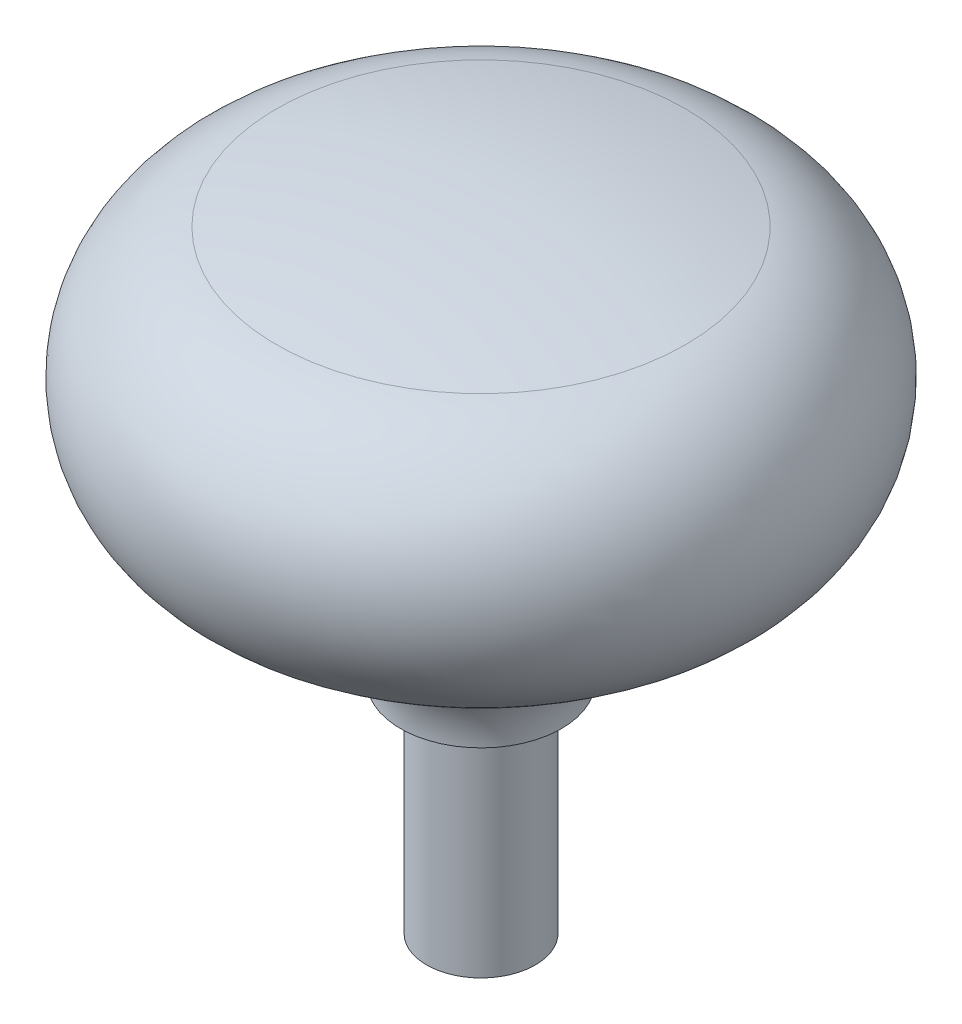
ISO-10303-21;
HEADER;
FILE_DESCRIPTION(('STEP AP214'),'2;1');
FILE_NAME('part.step','',(''),(''),'','','');
FILE_SCHEMA(('AUTOMOTIVE_DESIGN { 1 0 10303 214 1 1 1 1 }'));
ENDSEC;
DATA;
#1=APPLICATION_CONTEXT('core data for automotive mechanical design processes');
#2=APPLICATION_PROTOCOL_DEFINITION('international standard','automotive_design',2000,#1);
#3=PRODUCT_CONTEXT('',#1,'mechanical');
#4=PRODUCT('Part','Part','',(#3));
#5=PRODUCT_RELATED_PRODUCT_CATEGORY('part','',(#4));
#6=PRODUCT_DEFINITION_FORMATION('','',#4);
#7=PRODUCT_DEFINITION_CONTEXT('part definition',#1,'design');
#8=PRODUCT_DEFINITION('design','',#6,#7);
#9=PRODUCT_DEFINITION_SHAPE('','',#8);
#10=(LENGTH_UNIT() NAMED_UNIT(*) SI_UNIT(.MILLI.,.METRE.));
#11=(NAMED_UNIT(*) PLANE_ANGLE_UNIT() SI_UNIT($,.RADIAN.));
#12=(NAMED_UNIT(*) SI_UNIT($,.STERADIAN.) SOLID_ANGLE_UNIT());
#13=UNCERTAINTY_MEASURE_WITH_UNIT(LENGTH_MEASURE(1.E-05),#10,'distance_accuracy_value','');
#14=(GEOMETRIC_REPRESENTATION_CONTEXT(3) GLOBAL_UNCERTAINTY_ASSIGNED_CONTEXT((#13)) GLOBAL_UNIT_ASSIGNED_CONTEXT((#10,
#11,#12)) REPRESENTATION_CONTEXT('',''));
#15=CARTESIAN_POINT('',(0.,0.,0.));
#16=DIRECTION('',(0.,0.,1.));
#17=DIRECTION('',(1.,0.,0.));
#18=AXIS2_PLACEMENT_3D('',#15,#16,#17);
#19=CARTESIAN_POINT('',(0.,12.7,0.));
#20=DIRECTION('',(0.,-1.,0.));
#21=DIRECTION('',(0.,0.,-1.));
#22=AXIS2_PLACEMENT_3D('',#19,#20,#21);
#23=PLANE('',#22);
#24=CARTESIAN_POINT('',(0.,12.7,0.));
#25=DIRECTION('',(0.,-1.,0.));
#26=DIRECTION('',(0.,0.,-1.));
#27=AXIS2_PLACEMENT_3D('',#24,#25,#26);
#28=CIRCLE('',#27,4.699);
#29=CARTESIAN_POINT('',(0.,12.7,-4.699));
#30=VERTEX_POINT('',#29);
#31=EDGE_CURVE('E43',#30,#30,#28,.T.);
#32=ORIENTED_EDGE('',*,*,#31,.T.);
#33=EDGE_LOOP('',(#32));
#34=FACE_BOUND('',#33,.T.);
#35=CARTESIAN_POINT('',(0.,12.7,0.));
#36=DIRECTION('',(0.,-1.,0.));
#37=DIRECTION('',(0.,0.,-1.));
#38=AXIS2_PLACEMENT_3D('',#35,#36,#37);
#39=CIRCLE('',#38,3.175);
#40=CARTESIAN_POINT('',(0.,12.7,-3.175));
#41=VERTEX_POINT('',#40);
#42=EDGE_CURVE('E51',#41,#41,#39,.T.);
#43=ORIENTED_EDGE('',*,*,#42,.F.);
#44=EDGE_LOOP('',(#43));
#45=FACE_BOUND('',#44,.T.);
#46=ADVANCED_FACE('F28',(#34,#45),#23,.T.);
#47=CARTESIAN_POINT('',(0.,-15.7024831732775,0.));
#48=DIRECTION('',(0.,-1.,0.));
#49=DIRECTION('',(1.,0.,0.));
#50=AXIS2_PLACEMENT_3D('',#47,#48,#49);
#51=SPHERICAL_SURFACE('',#50,52.7696651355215);
#52=CARTESIAN_POINT('',(0.,35.7021440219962,0.));
#53=DIRECTION('',(0.,-1.,0.));
#54=DIRECTION('',(0.,0.,-1.));
#55=AXIS2_PLACEMENT_3D('',#52,#53,#54);
#56=CIRCLE('',#55,11.9248421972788);
#57=CARTESIAN_POINT('',(0.,35.7021440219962,-11.9248421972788));
#58=VERTEX_POINT('',#57);
#59=EDGE_CURVE('E10',#58,#58,#56,.F.);
#60=ORIENTED_EDGE('',*,*,#59,.T.);
#61=EDGE_LOOP('',(#60));
#62=FACE_BOUND('',#61,.T.);
#63=ADVANCED_FACE('F30',(#62),#51,.T.);
#64=CARTESIAN_POINT('',(0.,29.0752383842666,0.));
#65=DIRECTION('',(0.,1.,0.));
#66=DIRECTION('',(0.,0.,-1.));
#67=AXIS2_PLACEMENT_3D('',#64,#65,#66);
#68=CONICAL_SURFACE('',#67,27.9211964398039,1.06335562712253);
#69=CARTESIAN_POINT('',(0.,21.3070401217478,0.));
#70=DIRECTION('',(0.,1.,0.));
#71=DIRECTION('',(0.,0.,1.));
#72=AXIS2_PLACEMENT_3D('',#69,#70,#71);
#73=CIRCLE('',#72,13.9497035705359);
#74=CARTESIAN_POINT('',(0.,21.3070401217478,13.9497035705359));
#75=VERTEX_POINT('',#74);
#76=EDGE_CURVE('E35',#75,#75,#73,.F.);
#77=ORIENTED_EDGE('',*,*,#76,.T.);
#78=EDGE_LOOP('',(#77));
#79=FACE_BOUND('',#78,.T.);
#80=CARTESIAN_POINT('',(0.,17.8467341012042,0.));
#81=DIRECTION('',(0.,1.,0.));
#82=DIRECTION('',(0.,0.,1.));
#83=AXIS2_PLACEMENT_3D('',#80,#81,#82);
#84=CIRCLE('',#83,7.72617022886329);
#85=CARTESIAN_POINT('',(0.,17.8467341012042,7.72617022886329));
#86=VERTEX_POINT('',#85);
#87=EDGE_CURVE('E39',#86,#86,#84,.T.);
#88=ORIENTED_EDGE('',*,*,#87,.T.);
#89=EDGE_LOOP('',(#88));
#90=FACE_BOUND('',#89,.T.);
#91=ADVANCED_FACE('F63',(#79,#90),#68,.T.);
#92=CARTESIAN_POINT('',(0.,12.6999999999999,0.));
#93=DIRECTION('',(0.,-1.,0.));
#94=DIRECTION('',(0.,0.,-1.));
#95=AXIS2_PLACEMENT_3D('',#92,#93,#94);
#96=TOROIDAL_SURFACE('',#95,10.5877721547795,5.88877215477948);
#97=ORIENTED_EDGE('',*,*,#87,.F.);
#98=EDGE_LOOP('',(#97));
#99=FACE_BOUND('',#98,.T.);
#100=ORIENTED_EDGE('',*,*,#31,.F.);
#101=EDGE_LOOP('',(#100));
#102=FACE_BOUND('',#101,.T.);
#103=ADVANCED_FACE('F65',(#99,#102),#96,.F.);
#104=CARTESIAN_POINT('',(0.,28.1145905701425,0.));
#105=DIRECTION('',(0.,-1.,0.));
#106=DIRECTION('',(0.,0.,-1.));
#107=AXIS2_PLACEMENT_3D('',#104,#105,#106);
#108=TOROIDAL_SURFACE('',#107,10.1646820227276,7.78903917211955);
#109=ORIENTED_EDGE('',*,*,#59,.F.);
#110=EDGE_LOOP('',(#109));
#111=FACE_BOUND('',#110,.T.);
#112=ORIENTED_EDGE('',*,*,#76,.F.);
#113=EDGE_LOOP('',(#112));
#114=FACE_BOUND('',#113,.T.);
#115=ADVANCED_FACE('F71',(#111,#114),#108,.T.);
#116=CARTESIAN_POINT('',(0.,0.,0.));
#117=DIRECTION('',(0.,1.,0.));
#118=DIRECTION('',(0.,0.,1.));
#119=AXIS2_PLACEMENT_3D('',#116,#117,#118);
#120=CYLINDRICAL_SURFACE('',#119,3.175);
#121=CARTESIAN_POINT('',(0.,0.,0.));
#122=DIRECTION('',(0.,-1.,0.));
#123=DIRECTION('',(0.,0.,-1.));
#124=AXIS2_PLACEMENT_3D('',#121,#122,#123);
#125=CIRCLE('',#124,3.175);
#126=CARTESIAN_POINT('',(0.,0.,-3.175));
#127=VERTEX_POINT('',#126);
#128=EDGE_CURVE('E48',#127,#127,#125,.T.);
#129=ORIENTED_EDGE('',*,*,#128,.F.);
#130=EDGE_LOOP('',(#129));
#131=FACE_BOUND('',#130,.T.);
#132=ORIENTED_EDGE('',*,*,#42,.T.);
#133=EDGE_LOOP('',(#132));
#134=FACE_BOUND('',#133,.T.);
#135=ADVANCED_FACE('F55',(#131,#134),#120,.T.);
#136=CARTESIAN_POINT('',(0.,0.,0.));
#137=DIRECTION('',(0.,-1.,0.));
#138=DIRECTION('',(0.,0.,-1.));
#139=AXIS2_PLACEMENT_3D('',#136,#137,#138);
#140=PLANE('',#139);
#141=ORIENTED_EDGE('',*,*,#128,.T.);
#142=EDGE_LOOP('',(#141));
#143=FACE_BOUND('',#142,.T.);
#144=ADVANCED_FACE('F84',(#143),#140,.T.);
#145=CLOSED_SHELL('',(#46,#63,#91,#103,#115,#135,#144));
#146=MANIFOLD_SOLID_BREP('B2',#145);
#147=ADVANCED_BREP_SHAPE_REPRESENTATION('',(#18,#146),#14);
#148=SHAPE_DEFINITION_REPRESENTATION(#9,#147);
ENDSEC;
END-ISO-10303-21;
